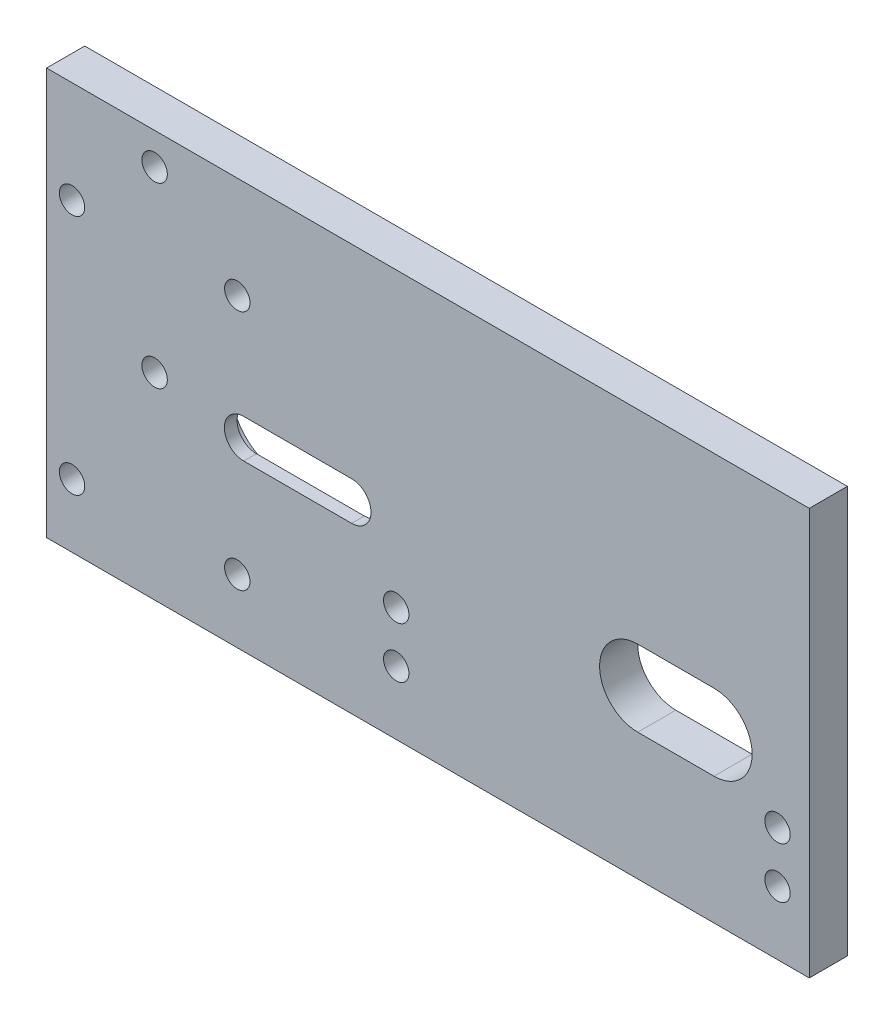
from build123d import *

# Parameters (mm, degrees)
SKETCH2_W           = 190.5
SKETCH2_H           = 101.6
SKETCH2_R           = 3.175
BOSS_EXTRUDE1_DEPTH = 9.525
CUT_EXTRUDE1_DEPTH  = 6.35


with BuildPart() as part:
    # Sketch2 → Boss-Extrude1 (new body)
    with BuildSketch(Plane.XY):
        with Locations((95.25, 50.8)):
            Rectangle(SKETCH2_W, SKETCH2_H)
        with Locations(Location((47.625, 15.8623, 0), (0, 0, 180))):
            Circle(SKETCH2_R, mode=Mode.SUBTRACT)
        with Locations(Location((6.35, 15.8623, 0), (0, 0, 180))):
            Circle(SKETCH2_R, mode=Mode.SUBTRACT)
        with Locations(Location((6.35, 76.1873, 0), (0, 0, 180))):
            Circle(SKETCH2_R, mode=Mode.SUBTRACT)
        with Locations(Location((47.625, 76.1873, 0), (0, 0, 180))):
            Circle(SKETCH2_R, mode=Mode.SUBTRACT)
        with Locations(Location((87.3252, 15.875, 0), (0, 0, 180))):
            Circle(SKETCH2_R, mode=Mode.SUBTRACT)
        with Locations(Location((87.3252, 28.575, 0), (0, 0, 180))):
            Circle(SKETCH2_R, mode=Mode.SUBTRACT)
        with Locations(Location((182.5752, 15.875, 0), (0, 0, 180))):
            Circle(SKETCH2_R, mode=Mode.SUBTRACT)
        with Locations(Location((182.5752, 28.575, 0), (0, 0, 180))):
            Circle(SKETCH2_R, mode=Mode.SUBTRACT)
        with Locations(Location((26.9748, 49.2252, 0), (0, 0, 180))):
            Circle(SKETCH2_R, mode=Mode.SUBTRACT)
        with Locations(Location((26.9748, 93.6752, 0), (0, 0, 180))):
            Circle(SKETCH2_R, mode=Mode.SUBTRACT)
        with BuildLine():
            Line((49.2252, 41.1988), (76.2, 41.1988))
            ThreePointArc((76.2, 41.1988), (81.026, 46.0248), (76.2, 50.8508))
            Line((76.2, 50.8508), (49.2252, 50.8508))
            ThreePointArc((49.2252, 50.8508), (44.3992, 46.0248), (49.2252, 41.1988))
        make_face(mode=Mode.SUBTRACT)
        with BuildLine():
            Line((147.6502, 31.75), (166.7002, 31.75))
            ThreePointArc((166.7002, 31.75), (176.2252, 41.275), (166.7002, 50.8))
            Line((166.7002, 50.8), (147.6502, 50.8))
            ThreePointArc((147.6502, 50.8), (138.1252, 41.275), (147.6502, 31.75))
        make_face(mode=Mode.SUBTRACT)
    extrude(amount=BOSS_EXTRUDE1_DEPTH)

    # Sketch3 → Cut-Extrude1 (cut)
    with BuildSketch(Plane.XY):
        with BuildLine():
            Line((49.2252, 33.3248), (76.2, 33.3248))
            ThreePointArc((76.2, 33.3248), (88.9, 46.0248), (76.2, 58.7248))
            Line((76.2, 58.7248), (49.2252, 58.7248))
            ThreePointArc((49.2252, 58.7248), (36.5252, 46.0248), (49.2252, 33.3248))
        make_face()
    extrude(amount=CUT_EXTRUDE1_DEPTH, mode=Mode.SUBTRACT)


solid = part.part
